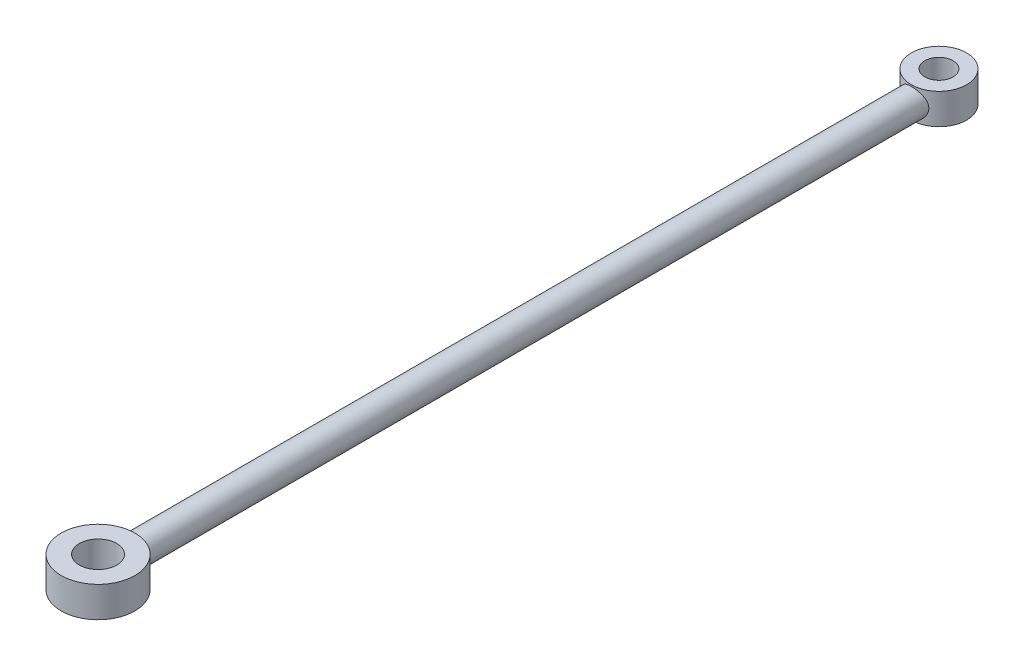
from build123d import *

# Parameters (mm, degrees)
SKETCH2_R                            = 6
BOSS_EXTRUDE1_DEPTH                  = 5
SKETCH3_R                            = 3.05
CUT_EXTRUDE1_DEPTH                   = 5
SKETCH4_R                            = 4.5
BOSS_EXTRUDE2_DEPTH                  = 5
SKETCH5_R                            = 2.3
CUT_EXTRUDE2_DEPTH                   = 5
BOSS_EXTRUDE3_REACH                  = 119.26
BOSS_EXTRUDE3_END_RADIUS             = 4.5
SKETCH8_R                            = 2.25
BOSS_EXTRUDE3_DIRECTION_2_REACH      = 119.26
BOSS_EXTRUDE3_DIRECTION_2_END_RADIUS = 6


with BuildPart() as part:
    # Sketch2 → Boss-Extrude1 (new body)
    with BuildSketch(Plane(origin=(0, 0, 0), x_dir=(1, 0, 0), z_dir=(0, 1, 0))):
        with Locations(Location((0, 0, 0), (0, 0, 270))):
            Circle(SKETCH2_R)
    extrude(amount=BOSS_EXTRUDE1_DEPTH)

    # Sketch3 → Cut-Extrude1 (cut)
    with BuildSketch(Plane(origin=(0, 5, 0), x_dir=(1, 0, 0), z_dir=(0, 1, 0))):
        with Locations(Location((0, 0, 0), (0, 0, 270))):
            Circle(SKETCH3_R)
    extrude(amount=-CUT_EXTRUDE1_DEPTH, mode=Mode.SUBTRACT)



with BuildPart() as body_2:
    # Sketch4 → Boss-Extrude2 (new body)
    with BuildSketch(Plane(origin=(0, 0, 0), x_dir=(1, 0, 0), z_dir=(0, 1, 0))):
        with Locations(Location((0, 137, 0), (0, 0, 270))):
            Circle(SKETCH4_R)
    extrude(amount=BOSS_EXTRUDE2_DEPTH)

    # Sketch5 → Cut-Extrude2 (cut)
    with BuildSketch(Plane(origin=(0, 5, 0), x_dir=(1, 0, 0), z_dir=(0, 1, 0))):
        with Locations(Location((0, 137, 0), (0, 0, 270))):
            Circle(SKETCH5_R)
    extrude(amount=-CUT_EXTRUDE2_DEPTH, mode=Mode.SUBTRACT)


with BuildPart() as part_1:
    add(part.part)

    add(body_2.part)  # Boss-Extrude3 merges body 2
    # Boss-Extrude3: up to this cylinder (the profile starts outside it)
    boss_extrude3_end = Plane(origin=(0, 2.5, -137), z_dir=(0, -1, 0)) * Cylinder(BOSS_EXTRUDE3_END_RADIUS, 248.52, mode=Mode.PRIVATE)
    # Sketch8 → Boss-Extrude3 (add, up to the surface)
    with BuildSketch(Plane(origin=(0, 0, -24.5), x_dir=(-1, 0, 0), z_dir=(0, 0, -1)), mode=Mode.PRIVATE) as boss_extrude3_sk1:
        with Locations((0, 2.5)):
            Circle(SKETCH8_R)
    boss_extrude3_tool1 = extrude(boss_extrude3_sk1.sketch, amount=BOSS_EXTRUDE3_REACH, mode=Mode.PRIVATE) - boss_extrude3_end
    add(boss_extrude3_tool1.solids().sort_by_distance((0, 2.5, -24.5))[0])

    # Boss-Extrude3 direction 2: up to this cylinder (the profile starts outside it)
    boss_extrude3_direction_2_end = Plane(origin=(0, 2.5, 0), z_dir=(0, -1, 0)) * Cylinder(BOSS_EXTRUDE3_DIRECTION_2_END_RADIUS, 251.52, mode=Mode.PRIVATE)
    # Sketch8 → Boss-Extrude3 direction 2 (add, up to the surface)
    with BuildSketch(Plane(origin=(0, 0, -24.5), x_dir=(-1, 0, 0), z_dir=(0, 0, -1)), mode=Mode.PRIVATE) as boss_extrude3_direction_2_sk1:
        with Locations((0, 2.5)):
            Circle(SKETCH8_R)
    boss_extrude3_direction_2_tool1 = extrude(boss_extrude3_direction_2_sk1.sketch, amount=-BOSS_EXTRUDE3_DIRECTION_2_REACH, mode=Mode.PRIVATE) - boss_extrude3_direction_2_end
    add(boss_extrude3_direction_2_tool1.solids().sort_by_distance((0, 2.5, -24.5))[0])


solid = part_1.part
